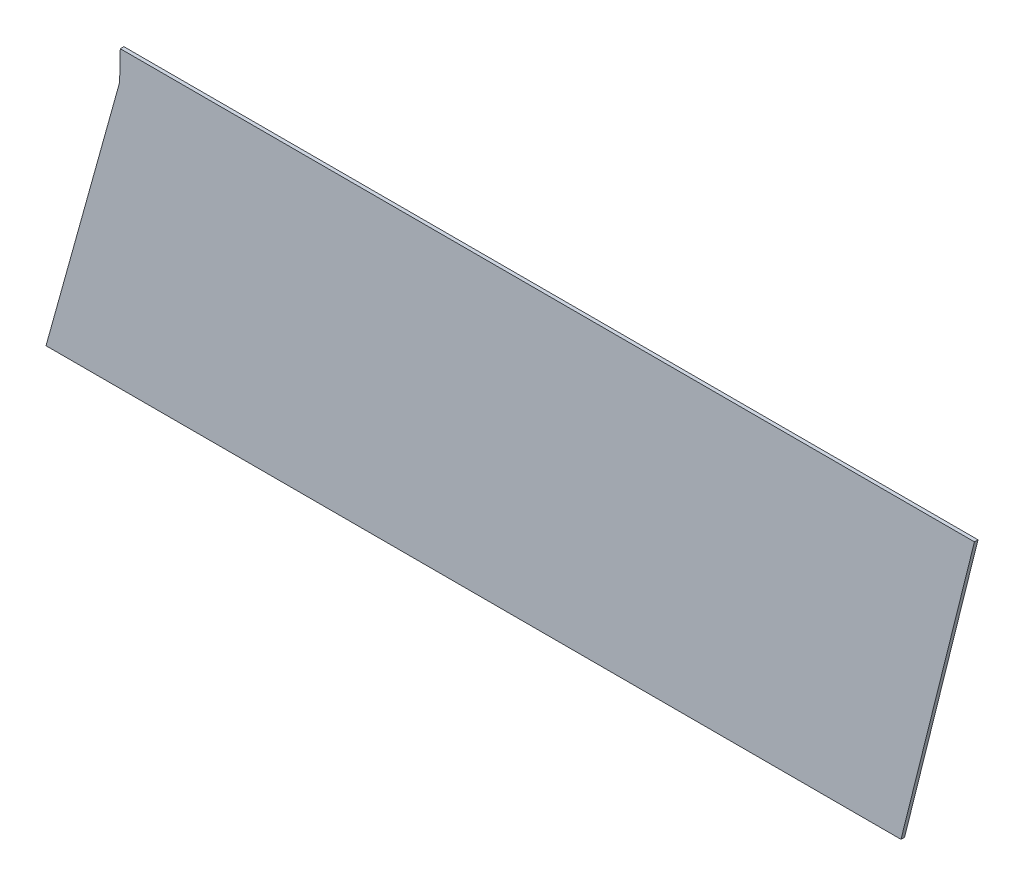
ISO-10303-21;
HEADER;
FILE_DESCRIPTION(('STEP AP214'),'2;1');
FILE_NAME('part.step','',(''),(''),'','','');
FILE_SCHEMA(('AUTOMOTIVE_DESIGN { 1 0 10303 214 1 1 1 1 }'));
ENDSEC;
DATA;
#1=APPLICATION_CONTEXT('core data for automotive mechanical design processes');
#2=APPLICATION_PROTOCOL_DEFINITION('international standard','automotive_design',2000,#1);
#3=PRODUCT_CONTEXT('',#1,'mechanical');
#4=PRODUCT('Part','Part','',(#3));
#5=PRODUCT_RELATED_PRODUCT_CATEGORY('part','',(#4));
#6=PRODUCT_DEFINITION_FORMATION('','',#4);
#7=PRODUCT_DEFINITION_CONTEXT('part definition',#1,'design');
#8=PRODUCT_DEFINITION('design','',#6,#7);
#9=PRODUCT_DEFINITION_SHAPE('','',#8);
#10=(LENGTH_UNIT() NAMED_UNIT(*) SI_UNIT(.MILLI.,.METRE.));
#11=(NAMED_UNIT(*) PLANE_ANGLE_UNIT() SI_UNIT($,.RADIAN.));
#12=(NAMED_UNIT(*) SI_UNIT($,.STERADIAN.) SOLID_ANGLE_UNIT());
#13=UNCERTAINTY_MEASURE_WITH_UNIT(LENGTH_MEASURE(1.E-05),#10,'distance_accuracy_value','');
#14=(GEOMETRIC_REPRESENTATION_CONTEXT(3) GLOBAL_UNCERTAINTY_ASSIGNED_CONTEXT((#13)) GLOBAL_UNIT_ASSIGNED_CONTEXT((#10,
#11,#12)) REPRESENTATION_CONTEXT('',''));
#15=CARTESIAN_POINT('',(0.,0.,0.));
#16=DIRECTION('',(0.,0.,1.));
#17=DIRECTION('',(1.,0.,0.));
#18=AXIS2_PLACEMENT_3D('',#15,#16,#17);
#19=CARTESIAN_POINT('',(1196.56406460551,3938.85292152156,5.));
#20=DIRECTION('',(-0.970271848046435,0.242017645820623,0.));
#21=DIRECTION('',(-0.242017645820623,-0.970271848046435,0.));
#22=AXIS2_PLACEMENT_3D('',#19,#20,#21);
#23=PLANE('',#22);
#24=DIRECTION('',(0.242017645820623,0.970271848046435,0.));
#25=VECTOR('',#24,1.);
#26=CARTESIAN_POINT('',(1196.56406460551,3938.85292152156,0.));
#27=LINE('',#26,#25);
#28=CARTESIAN_POINT('',(1196.56406460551,3938.85292152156,0.));
#29=VERTEX_POINT('',#28);
#30=CARTESIAN_POINT('',(1299.33038754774,4350.85292152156,0.));
#31=VERTEX_POINT('',#30);
#32=EDGE_CURVE('E74',#29,#31,#27,.T.);
#33=ORIENTED_EDGE('',*,*,#32,.T.);
#34=DIRECTION('',(0.,0.,-1.));
#35=VECTOR('',#34,1.);
#36=CARTESIAN_POINT('',(1299.33038754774,4350.85292152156,5.));
#37=LINE('',#36,#35);
#38=CARTESIAN_POINT('',(1299.33038754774,4350.85292152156,5.));
#39=VERTEX_POINT('',#38);
#40=EDGE_CURVE('E11',#39,#31,#37,.T.);
#41=ORIENTED_EDGE('',*,*,#40,.F.);
#42=DIRECTION('',(0.242017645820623,0.970271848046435,0.));
#43=VECTOR('',#42,1.);
#44=CARTESIAN_POINT('',(1196.56406460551,3938.85292152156,5.));
#45=LINE('',#44,#43);
#46=CARTESIAN_POINT('',(1196.56406460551,3938.85292152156,5.));
#47=VERTEX_POINT('',#46);
#48=EDGE_CURVE('E95',#47,#39,#45,.T.);
#49=ORIENTED_EDGE('',*,*,#48,.F.);
#50=DIRECTION('',(0.,0.,-1.));
#51=VECTOR('',#50,1.);
#52=CARTESIAN_POINT('',(1196.56406460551,3938.85292152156,5.));
#53=LINE('',#52,#51);
#54=EDGE_CURVE('E87',#47,#29,#53,.T.);
#55=ORIENTED_EDGE('',*,*,#54,.T.);
#56=EDGE_LOOP('',(#33,#41,#49,#55));
#57=FACE_BOUND('',#56,.T.);
#58=ADVANCED_FACE('F24',(#57),#23,.F.);
#59=CARTESIAN_POINT('',(1196.56406460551,4350.85292152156,5.));
#60=DIRECTION('',(0.,-1.,0.));
#61=DIRECTION('',(0.,0.,-1.));
#62=AXIS2_PLACEMENT_3D('',#59,#60,#61);
#63=PLANE('',#62);
#64=DIRECTION('',(-1.,0.,0.));
#65=VECTOR('',#64,1.);
#66=CARTESIAN_POINT('',(1196.56406460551,4350.85292152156,0.));
#67=LINE('',#66,#65);
#68=CARTESIAN_POINT('',(103.946267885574,4350.85292152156,0.));
#69=VERTEX_POINT('',#68);
#70=EDGE_CURVE('E70',#31,#69,#67,.T.);
#71=ORIENTED_EDGE('',*,*,#70,.T.);
#72=DIRECTION('',(0.,0.,-1.));
#73=VECTOR('',#72,1.);
#74=CARTESIAN_POINT('',(103.946267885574,4350.85292152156,5.));
#75=LINE('',#74,#73);
#76=CARTESIAN_POINT('',(103.946267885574,4350.85292152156,5.));
#77=VERTEX_POINT('',#76);
#78=EDGE_CURVE('E31',#77,#69,#75,.T.);
#79=ORIENTED_EDGE('',*,*,#78,.F.);
#80=DIRECTION('',(-1.,0.,0.));
#81=VECTOR('',#80,1.);
#82=CARTESIAN_POINT('',(1299.33038754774,4350.85292152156,5.));
#83=LINE('',#82,#81);
#84=EDGE_CURVE('E83',#39,#77,#83,.T.);
#85=ORIENTED_EDGE('',*,*,#84,.F.);
#86=ORIENTED_EDGE('',*,*,#40,.T.);
#87=EDGE_LOOP('',(#71,#79,#85,#86));
#88=FACE_BOUND('',#87,.T.);
#89=ADVANCED_FACE('F82',(#88),#63,.F.);
#90=CARTESIAN_POINT('',(103.946267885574,4350.85292152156,5.));
#91=DIRECTION('',(0.999750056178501,-0.02235677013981,0.));
#92=DIRECTION('',(0.02235677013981,0.999750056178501,0.));
#93=AXIS2_PLACEMENT_3D('',#90,#91,#92);
#94=PLANE('',#93);
#95=DIRECTION('',(-0.02235677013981,-0.999750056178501,0.));
#96=VECTOR('',#95,1.);
#97=CARTESIAN_POINT('',(103.946267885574,4350.85292152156,0.));
#98=LINE('',#97,#96);
#99=CARTESIAN_POINT('',(103.021615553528,4309.50431816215,0.));
#100=VERTEX_POINT('',#99);
#101=EDGE_CURVE('E76',#69,#100,#98,.T.);
#102=ORIENTED_EDGE('',*,*,#101,.T.);
#103=DIRECTION('',(0.,0.,-1.));
#104=VECTOR('',#103,1.);
#105=CARTESIAN_POINT('',(103.021615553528,4309.50431816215,5.));
#106=LINE('',#105,#104);
#107=CARTESIAN_POINT('',(103.021615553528,4309.50431816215,5.));
#108=VERTEX_POINT('',#107);
#109=EDGE_CURVE('E106',#108,#100,#106,.T.);
#110=ORIENTED_EDGE('',*,*,#109,.F.);
#111=DIRECTION('',(-0.02235677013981,-0.999750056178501,0.));
#112=VECTOR('',#111,1.);
#113=CARTESIAN_POINT('',(103.946267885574,4350.85292152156,5.));
#114=LINE('',#113,#112);
#115=EDGE_CURVE('E98',#77,#108,#114,.T.);
#116=ORIENTED_EDGE('',*,*,#115,.F.);
#117=ORIENTED_EDGE('',*,*,#78,.T.);
#118=EDGE_LOOP('',(#102,#110,#116,#117));
#119=FACE_BOUND('',#118,.T.);
#120=ADVANCED_FACE('F110',(#119),#94,.F.);
#121=CARTESIAN_POINT('',(103.021615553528,4309.50431816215,5.));
#122=DIRECTION('',(0.963475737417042,-0.267795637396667,0.));
#123=DIRECTION('',(0.267795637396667,0.963475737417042,0.));
#124=AXIS2_PLACEMENT_3D('',#121,#122,#123);
#125=PLANE('',#124);
#126=DIRECTION('',(-0.267795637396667,-0.963475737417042,0.));
#127=VECTOR('',#126,1.);
#128=CARTESIAN_POINT('',(103.021615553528,4309.50431816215,0.));
#129=LINE('',#128,#127);
#130=CARTESIAN_POINT('',(0.,3938.85292152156,0.));
#131=VERTEX_POINT('',#130);
#132=EDGE_CURVE('E91',#100,#131,#129,.T.);
#133=ORIENTED_EDGE('',*,*,#132,.T.);
#134=DIRECTION('',(0.,0.,-1.));
#135=VECTOR('',#134,1.);
#136=CARTESIAN_POINT('',(0.,3938.85292152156,5.));
#137=LINE('',#136,#135);
#138=CARTESIAN_POINT('',(0.,3938.85292152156,5.));
#139=VERTEX_POINT('',#138);
#140=EDGE_CURVE('E103',#139,#131,#137,.T.);
#141=ORIENTED_EDGE('',*,*,#140,.F.);
#142=DIRECTION('',(-0.267795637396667,-0.963475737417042,0.));
#143=VECTOR('',#142,1.);
#144=CARTESIAN_POINT('',(103.021615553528,4309.50431816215,5.));
#145=LINE('',#144,#143);
#146=EDGE_CURVE('E43',#108,#139,#145,.T.);
#147=ORIENTED_EDGE('',*,*,#146,.F.);
#148=ORIENTED_EDGE('',*,*,#109,.T.);
#149=EDGE_LOOP('',(#133,#141,#147,#148));
#150=FACE_BOUND('',#149,.T.);
#151=ADVANCED_FACE('F121',(#150),#125,.F.);
#152=CARTESIAN_POINT('',(1196.56406460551,3938.85292152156,5.));
#153=DIRECTION('',(0.,1.,0.));
#154=DIRECTION('',(0.,0.,1.));
#155=AXIS2_PLACEMENT_3D('',#152,#153,#154);
#156=PLANE('',#155);
#157=DIRECTION('',(1.,0.,0.));
#158=VECTOR('',#157,1.);
#159=CARTESIAN_POINT('',(1196.56406460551,3938.85292152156,0.));
#160=LINE('',#159,#158);
#161=EDGE_CURVE('E93',#131,#29,#160,.T.);
#162=ORIENTED_EDGE('',*,*,#161,.T.);
#163=ORIENTED_EDGE('',*,*,#54,.F.);
#164=DIRECTION('',(1.,0.,0.));
#165=VECTOR('',#164,1.);
#166=CARTESIAN_POINT('',(1196.56406460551,3938.85292152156,5.));
#167=LINE('',#166,#165);
#168=EDGE_CURVE('E38',#139,#47,#167,.T.);
#169=ORIENTED_EDGE('',*,*,#168,.F.);
#170=ORIENTED_EDGE('',*,*,#140,.T.);
#171=EDGE_LOOP('',(#162,#163,#169,#170));
#172=FACE_BOUND('',#171,.T.);
#173=ADVANCED_FACE('F114',(#172),#156,.F.);
#174=CARTESIAN_POINT('',(1299.33038754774,4350.85292152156,5.));
#175=DIRECTION('',(0.,0.,1.));
#176=DIRECTION('',(1.,0.,0.));
#177=AXIS2_PLACEMENT_3D('',#174,#175,#176);
#178=PLANE('',#177);
#179=ORIENTED_EDGE('',*,*,#48,.T.);
#180=ORIENTED_EDGE('',*,*,#84,.T.);
#181=ORIENTED_EDGE('',*,*,#115,.T.);
#182=ORIENTED_EDGE('',*,*,#146,.T.);
#183=ORIENTED_EDGE('',*,*,#168,.T.);
#184=EDGE_LOOP('',(#179,#180,#181,#182,#183));
#185=FACE_BOUND('',#184,.T.);
#186=ADVANCED_FACE('F112',(#185),#178,.T.);
#187=CARTESIAN_POINT('',(1299.33038754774,4350.85292152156,0.));
#188=DIRECTION('',(0.,0.,1.));
#189=DIRECTION('',(1.,0.,0.));
#190=AXIS2_PLACEMENT_3D('',#187,#188,#189);
#191=PLANE('',#190);
#192=ORIENTED_EDGE('',*,*,#32,.F.);
#193=ORIENTED_EDGE('',*,*,#161,.F.);
#194=ORIENTED_EDGE('',*,*,#132,.F.);
#195=ORIENTED_EDGE('',*,*,#101,.F.);
#196=ORIENTED_EDGE('',*,*,#70,.F.);
#197=EDGE_LOOP('',(#192,#193,#194,#195,#196));
#198=FACE_BOUND('',#197,.T.);
#199=ADVANCED_FACE('F71',(#198),#191,.F.);
#200=CLOSED_SHELL('',(#58,#89,#120,#151,#173,#186,#199));
#201=MANIFOLD_SOLID_BREP('B2',#200);
#202=ADVANCED_BREP_SHAPE_REPRESENTATION('',(#18,#201),#14);
#203=SHAPE_DEFINITION_REPRESENTATION(#9,#202);
ENDSEC;
END-ISO-10303-21;
